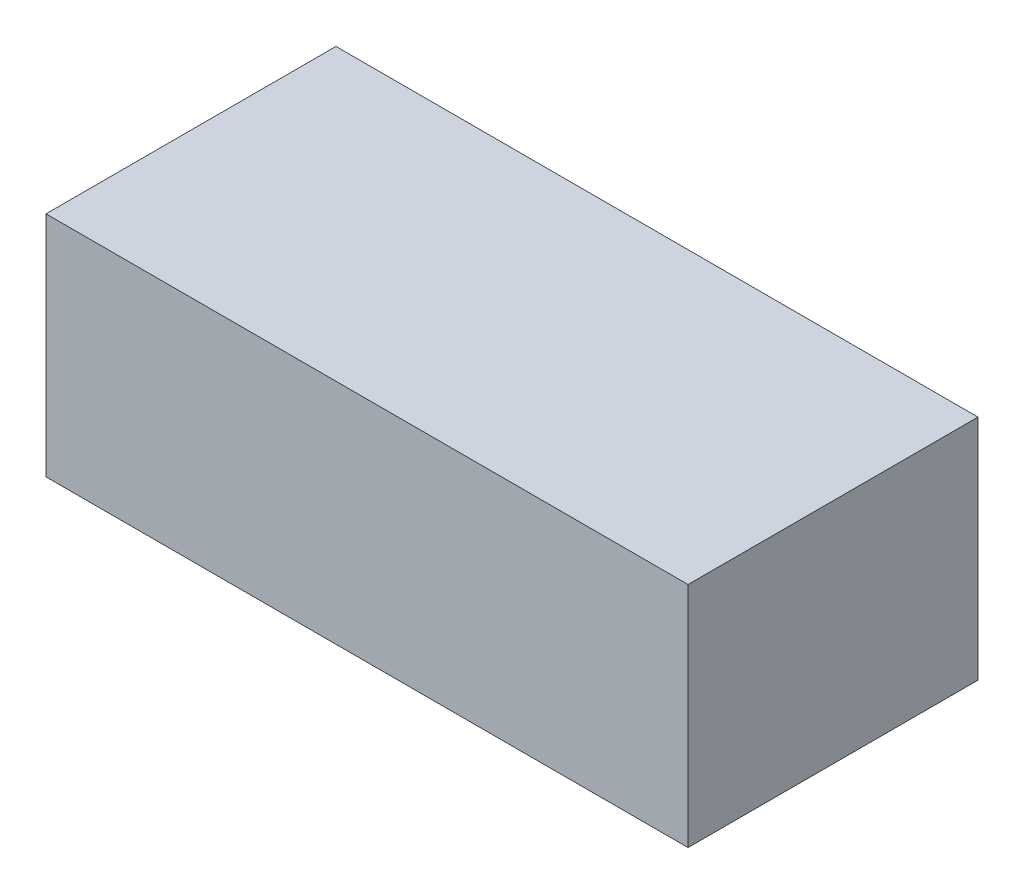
ISO-10303-21;
HEADER;
FILE_DESCRIPTION(('STEP AP214'),'2;1');
FILE_NAME('part.step','',(''),(''),'','','');
FILE_SCHEMA(('AUTOMOTIVE_DESIGN { 1 0 10303 214 1 1 1 1 }'));
ENDSEC;
DATA;
#1=APPLICATION_CONTEXT('core data for automotive mechanical design processes');
#2=APPLICATION_PROTOCOL_DEFINITION('international standard','automotive_design',2000,#1);
#3=PRODUCT_CONTEXT('',#1,'mechanical');
#4=PRODUCT('Part','Part','',(#3));
#5=PRODUCT_RELATED_PRODUCT_CATEGORY('part','',(#4));
#6=PRODUCT_DEFINITION_FORMATION('','',#4);
#7=PRODUCT_DEFINITION_CONTEXT('part definition',#1,'design');
#8=PRODUCT_DEFINITION('design','',#6,#7);
#9=PRODUCT_DEFINITION_SHAPE('','',#8);
#10=(LENGTH_UNIT() NAMED_UNIT(*) SI_UNIT(.MILLI.,.METRE.));
#11=(NAMED_UNIT(*) PLANE_ANGLE_UNIT() SI_UNIT($,.RADIAN.));
#12=(NAMED_UNIT(*) SI_UNIT($,.STERADIAN.) SOLID_ANGLE_UNIT());
#13=UNCERTAINTY_MEASURE_WITH_UNIT(LENGTH_MEASURE(1.E-05),#10,'distance_accuracy_value','');
#14=(GEOMETRIC_REPRESENTATION_CONTEXT(3) GLOBAL_UNCERTAINTY_ASSIGNED_CONTEXT((#13)) GLOBAL_UNIT_ASSIGNED_CONTEXT((#10,
#11,#12)) REPRESENTATION_CONTEXT('',''));
#15=CARTESIAN_POINT('',(0.,0.,0.));
#16=DIRECTION('',(0.,0.,1.));
#17=DIRECTION('',(1.,0.,0.));
#18=AXIS2_PLACEMENT_3D('',#15,#16,#17);
#19=CARTESIAN_POINT('',(15.5,11.,-7.));
#20=DIRECTION('',(-1.,0.,0.));
#21=DIRECTION('',(0.,0.,1.));
#22=AXIS2_PLACEMENT_3D('',#19,#20,#21);
#23=PLANE('',#22);
#24=DIRECTION('',(0.,0.,-1.));
#25=VECTOR('',#24,1.);
#26=CARTESIAN_POINT('',(15.5,0.,-7.));
#27=LINE('',#26,#25);
#28=CARTESIAN_POINT('',(15.5,0.,7.));
#29=VERTEX_POINT('',#28);
#30=CARTESIAN_POINT('',(15.5,0.,-7.));
#31=VERTEX_POINT('',#30);
#32=EDGE_CURVE('E98',#29,#31,#27,.T.);
#33=ORIENTED_EDGE('',*,*,#32,.T.);
#34=DIRECTION('',(0.,-1.,0.));
#35=VECTOR('',#34,1.);
#36=CARTESIAN_POINT('',(15.5,11.,-7.));
#37=LINE('',#36,#35);
#38=CARTESIAN_POINT('',(15.5,11.,-7.));
#39=VERTEX_POINT('',#38);
#40=EDGE_CURVE('E11',#39,#31,#37,.T.);
#41=ORIENTED_EDGE('',*,*,#40,.F.);
#42=DIRECTION('',(0.,0.,-1.));
#43=VECTOR('',#42,1.);
#44=CARTESIAN_POINT('',(15.5,11.,-7.));
#45=LINE('',#44,#43);
#46=CARTESIAN_POINT('',(15.5,11.,7.));
#47=VERTEX_POINT('',#46);
#48=EDGE_CURVE('E86',#47,#39,#45,.T.);
#49=ORIENTED_EDGE('',*,*,#48,.F.);
#50=DIRECTION('',(0.,-1.,0.));
#51=VECTOR('',#50,1.);
#52=CARTESIAN_POINT('',(15.5,11.,7.));
#53=LINE('',#52,#51);
#54=EDGE_CURVE('E94',#47,#29,#53,.T.);
#55=ORIENTED_EDGE('',*,*,#54,.T.);
#56=EDGE_LOOP('',(#33,#41,#49,#55));
#57=FACE_BOUND('',#56,.T.);
#58=ADVANCED_FACE('F35',(#57),#23,.F.);
#59=CARTESIAN_POINT('',(-15.5,11.,-7.));
#60=DIRECTION('',(0.,0.,1.));
#61=DIRECTION('',(1.,0.,0.));
#62=AXIS2_PLACEMENT_3D('',#59,#60,#61);
#63=PLANE('',#62);
#64=DIRECTION('',(-1.,0.,0.));
#65=VECTOR('',#64,1.);
#66=CARTESIAN_POINT('',(-15.5,0.,-7.));
#67=LINE('',#66,#65);
#68=CARTESIAN_POINT('',(-15.5,0.,-7.));
#69=VERTEX_POINT('',#68);
#70=EDGE_CURVE('E90',#31,#69,#67,.T.);
#71=ORIENTED_EDGE('',*,*,#70,.T.);
#72=DIRECTION('',(0.,-1.,0.));
#73=VECTOR('',#72,1.);
#74=CARTESIAN_POINT('',(-15.5,11.,-7.));
#75=LINE('',#74,#73);
#76=CARTESIAN_POINT('',(-15.5,11.,-7.));
#77=VERTEX_POINT('',#76);
#78=EDGE_CURVE('E43',#77,#69,#75,.T.);
#79=ORIENTED_EDGE('',*,*,#78,.F.);
#80=DIRECTION('',(-1.,0.,0.));
#81=VECTOR('',#80,1.);
#82=CARTESIAN_POINT('',(-15.5,11.,-7.));
#83=LINE('',#82,#81);
#84=EDGE_CURVE('E81',#39,#77,#83,.T.);
#85=ORIENTED_EDGE('',*,*,#84,.F.);
#86=ORIENTED_EDGE('',*,*,#40,.T.);
#87=EDGE_LOOP('',(#71,#79,#85,#86));
#88=FACE_BOUND('',#87,.T.);
#89=ADVANCED_FACE('F89',(#88),#63,.F.);
#90=CARTESIAN_POINT('',(-15.5,11.,-7.));
#91=DIRECTION('',(1.,0.,0.));
#92=DIRECTION('',(0.,0.,-1.));
#93=AXIS2_PLACEMENT_3D('',#90,#91,#92);
#94=PLANE('',#93);
#95=DIRECTION('',(0.,0.,1.));
#96=VECTOR('',#95,1.);
#97=CARTESIAN_POINT('',(-15.5,0.,-7.));
#98=LINE('',#97,#96);
#99=CARTESIAN_POINT('',(-15.5,0.,7.));
#100=VERTEX_POINT('',#99);
#101=EDGE_CURVE('E68',#69,#100,#98,.T.);
#102=ORIENTED_EDGE('',*,*,#101,.T.);
#103=DIRECTION('',(0.,-1.,0.));
#104=VECTOR('',#103,1.);
#105=CARTESIAN_POINT('',(-15.5,11.,7.));
#106=LINE('',#105,#104);
#107=CARTESIAN_POINT('',(-15.5,11.,7.));
#108=VERTEX_POINT('',#107);
#109=EDGE_CURVE('E91',#108,#100,#106,.T.);
#110=ORIENTED_EDGE('',*,*,#109,.F.);
#111=DIRECTION('',(0.,0.,1.));
#112=VECTOR('',#111,1.);
#113=CARTESIAN_POINT('',(-15.5,11.,-7.));
#114=LINE('',#113,#112);
#115=EDGE_CURVE('E84',#77,#108,#114,.T.);
#116=ORIENTED_EDGE('',*,*,#115,.F.);
#117=ORIENTED_EDGE('',*,*,#78,.T.);
#118=EDGE_LOOP('',(#102,#110,#116,#117));
#119=FACE_BOUND('',#118,.T.);
#120=ADVANCED_FACE('F92',(#119),#94,.F.);
#121=CARTESIAN_POINT('',(-15.5,11.,7.));
#122=DIRECTION('',(0.,0.,-1.));
#123=DIRECTION('',(-1.,0.,0.));
#124=AXIS2_PLACEMENT_3D('',#121,#122,#123);
#125=PLANE('',#124);
#126=DIRECTION('',(1.,0.,0.));
#127=VECTOR('',#126,1.);
#128=CARTESIAN_POINT('',(-15.5,0.,7.));
#129=LINE('',#128,#127);
#130=EDGE_CURVE('E74',#100,#29,#129,.T.);
#131=ORIENTED_EDGE('',*,*,#130,.T.);
#132=ORIENTED_EDGE('',*,*,#54,.F.);
#133=DIRECTION('',(1.,0.,0.));
#134=VECTOR('',#133,1.);
#135=CARTESIAN_POINT('',(-15.5,11.,7.));
#136=LINE('',#135,#134);
#137=EDGE_CURVE('E51',#108,#47,#136,.T.);
#138=ORIENTED_EDGE('',*,*,#137,.F.);
#139=ORIENTED_EDGE('',*,*,#109,.T.);
#140=EDGE_LOOP('',(#131,#132,#138,#139));
#141=FACE_BOUND('',#140,.T.);
#142=ADVANCED_FACE('F105',(#141),#125,.F.);
#143=CARTESIAN_POINT('',(0.,11.,0.));
#144=DIRECTION('',(0.,1.,0.));
#145=DIRECTION('',(0.,0.,1.));
#146=AXIS2_PLACEMENT_3D('',#143,#144,#145);
#147=PLANE('',#146);
#148=ORIENTED_EDGE('',*,*,#48,.T.);
#149=ORIENTED_EDGE('',*,*,#84,.T.);
#150=ORIENTED_EDGE('',*,*,#115,.T.);
#151=ORIENTED_EDGE('',*,*,#137,.T.);
#152=EDGE_LOOP('',(#148,#149,#150,#151));
#153=FACE_BOUND('',#152,.T.);
#154=ADVANCED_FACE('F82',(#153),#147,.T.);
#155=CARTESIAN_POINT('',(0.,0.,0.));
#156=DIRECTION('',(0.,1.,0.));
#157=DIRECTION('',(0.,0.,1.));
#158=AXIS2_PLACEMENT_3D('',#155,#156,#157);
#159=PLANE('',#158);
#160=ORIENTED_EDGE('',*,*,#32,.F.);
#161=ORIENTED_EDGE('',*,*,#130,.F.);
#162=ORIENTED_EDGE('',*,*,#101,.F.);
#163=ORIENTED_EDGE('',*,*,#70,.F.);
#164=EDGE_LOOP('',(#160,#161,#162,#163));
#165=FACE_BOUND('',#164,.T.);
#166=ADVANCED_FACE('F108',(#165),#159,.F.);
#167=CLOSED_SHELL('',(#58,#89,#120,#142,#154,#166));
#168=MANIFOLD_SOLID_BREP('B2',#167);
#169=ADVANCED_BREP_SHAPE_REPRESENTATION('',(#18,#168),#14);
#170=SHAPE_DEFINITION_REPRESENTATION(#9,#169);
ENDSEC;
END-ISO-10303-21;
